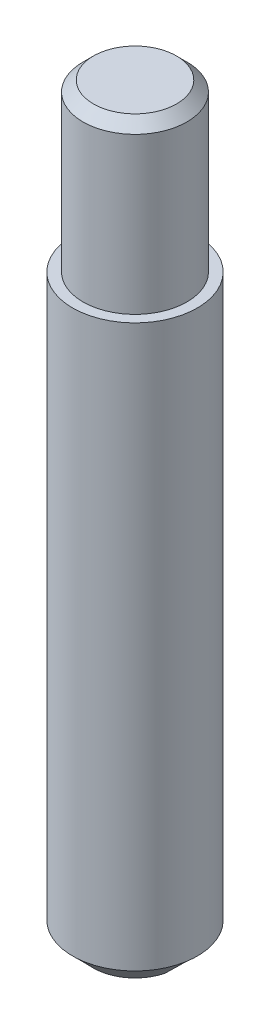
ISO-10303-21;
HEADER;
FILE_DESCRIPTION(('STEP AP214'),'2;1');
FILE_NAME('part.step','',(''),(''),'','','');
FILE_SCHEMA(('AUTOMOTIVE_DESIGN { 1 0 10303 214 1 1 1 1 }'));
ENDSEC;
DATA;
#1=APPLICATION_CONTEXT('core data for automotive mechanical design processes');
#2=APPLICATION_PROTOCOL_DEFINITION('international standard','automotive_design',2000,#1);
#3=PRODUCT_CONTEXT('',#1,'mechanical');
#4=PRODUCT('Part','Part','',(#3));
#5=PRODUCT_RELATED_PRODUCT_CATEGORY('part','',(#4));
#6=PRODUCT_DEFINITION_FORMATION('','',#4);
#7=PRODUCT_DEFINITION_CONTEXT('part definition',#1,'design');
#8=PRODUCT_DEFINITION('design','',#6,#7);
#9=PRODUCT_DEFINITION_SHAPE('','',#8);
#10=(LENGTH_UNIT() NAMED_UNIT(*) SI_UNIT(.MILLI.,.METRE.));
#11=(NAMED_UNIT(*) PLANE_ANGLE_UNIT() SI_UNIT($,.RADIAN.));
#12=(NAMED_UNIT(*) SI_UNIT($,.STERADIAN.) SOLID_ANGLE_UNIT());
#13=UNCERTAINTY_MEASURE_WITH_UNIT(LENGTH_MEASURE(1.E-05),#10,'distance_accuracy_value','');
#14=(GEOMETRIC_REPRESENTATION_CONTEXT(3) GLOBAL_UNCERTAINTY_ASSIGNED_CONTEXT((#13)) GLOBAL_UNIT_ASSIGNED_CONTEXT((#10,
#11,#12)) REPRESENTATION_CONTEXT('',''));
#15=CARTESIAN_POINT('',(0.,0.,0.));
#16=DIRECTION('',(0.,0.,1.));
#17=DIRECTION('',(1.,0.,0.));
#18=AXIS2_PLACEMENT_3D('',#15,#16,#17);
#19=CARTESIAN_POINT('',(0.,0.,0.));
#20=DIRECTION('',(0.,1.,0.));
#21=DIRECTION('',(0.,0.,1.));
#22=AXIS2_PLACEMENT_3D('',#19,#20,#21);
#23=PLANE('',#22);
#24=CARTESIAN_POINT('',(0.,0.,0.));
#25=DIRECTION('',(0.,1.,0.));
#26=DIRECTION('',(0.,0.,1.));
#27=AXIS2_PLACEMENT_3D('',#24,#25,#26);
#28=CIRCLE('',#27,2.);
#29=CARTESIAN_POINT('',(-1.93649167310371,0.,-0.5));
#30=VERTEX_POINT('',#29);
#31=CARTESIAN_POINT('',(1.93649167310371,0.,-0.5));
#32=VERTEX_POINT('',#31);
#33=EDGE_CURVE('E89',#30,#32,#28,.F.);
#34=ORIENTED_EDGE('',*,*,#33,.T.);
#35=DIRECTION('',(1.,0.,0.));
#36=VECTOR('',#35,1.);
#37=CARTESIAN_POINT('',(-4.0373892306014,0.,-0.5));
#38=LINE('',#37,#36);
#39=EDGE_CURVE('E87',#30,#32,#38,.T.);
#40=ORIENTED_EDGE('',*,*,#39,.F.);
#41=EDGE_LOOP('',(#34,#40));
#42=FACE_BOUND('',#41,.T.);
#43=ADVANCED_FACE('F30',(#42),#23,.F.);
#44=CARTESIAN_POINT('',(0.,0.999999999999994,0.));
#45=DIRECTION('',(0.,1.,0.));
#46=DIRECTION('',(0.,0.,1.));
#47=AXIS2_PLACEMENT_3D('',#44,#45,#46);
#48=CONICAL_SURFACE('',#47,3.,0.78539816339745);
#49=CARTESIAN_POINT('',(-6.63103347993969,4.64985751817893,-0.5));
#50=CARTESIAN_POINT('',(-6.39629582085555,4.41579013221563,-0.5));
#51=CARTESIAN_POINT('',(-6.1615284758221,4.18175248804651,-0.5));
#52=CARTESIAN_POINT('',(-5.69188584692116,3.71376898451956,-0.5));
#53=CARTESIAN_POINT('',(-5.45701055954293,3.47982312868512,-0.5));
#54=CARTESIAN_POINT('',(-4.98691869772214,3.0118716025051,-0.5));
#55=CARTESIAN_POINT('',(-4.75170200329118,2.77786605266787,-0.5));
#56=CARTESIAN_POINT('',(-4.28105975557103,2.31008118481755,-0.5));
#57=CARTESIAN_POINT('',(-4.04563420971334,2.07630185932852,-0.5));
#58=CARTESIAN_POINT('',(-3.58442332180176,1.61900696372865,-0.5));
#59=CARTESIAN_POINT('',(-3.35865262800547,1.39547663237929,-0.5));
#60=CARTESIAN_POINT('',(-3.01954668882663,1.06061302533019,-0.5));
#61=CARTESIAN_POINT('',(-2.90643048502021,0.949058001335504,-0.5));
#62=CARTESIAN_POINT('',(-2.67999103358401,0.726160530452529,-0.5));
#63=CARTESIAN_POINT('',(-2.56666778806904,0.614818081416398,-0.5));
#64=CARTESIAN_POINT('',(-2.33977921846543,0.392498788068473,-0.5));
#65=CARTESIAN_POINT('',(-2.22621405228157,0.281521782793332,-0.5));
#66=CARTESIAN_POINT('',(-1.99861397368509,0.0600415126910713,-0.5));
#67=CARTESIAN_POINT('',(-1.88457904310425,-0.0504617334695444,-0.5));
#68=CARTESIAN_POINT('',(-1.65577376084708,-0.270666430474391,-0.5));
#69=CARTESIAN_POINT('',(-1.54100354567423,-0.380368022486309,-0.5));
#70=CARTESIAN_POINT('',(-1.36779766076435,-0.543800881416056,-0.5));
#71=CARTESIAN_POINT('',(-1.30988912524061,-0.598090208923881,-0.5));
#72=CARTESIAN_POINT('',(-1.19356388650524,-0.706121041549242,-0.5));
#73=CARTESIAN_POINT('',(-1.13514719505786,-0.759862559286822,-0.5));
#74=CARTESIAN_POINT('',(-1.04371167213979,-0.842784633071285,-0.5));
#75=CARTESIAN_POINT('',(-1.01095596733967,-0.872255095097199,-0.5));
#76=CARTESIAN_POINT('',(-0.945138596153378,-0.930859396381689,-0.5));
#77=CARTESIAN_POINT('',(-0.912076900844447,-0.95999320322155,-0.5));
#78=CARTESIAN_POINT('',(-0.845330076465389,-1.01800796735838,-0.5));
#79=CARTESIAN_POINT('',(-0.811642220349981,-1.04688579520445,-0.5));
#80=CARTESIAN_POINT('',(-0.743741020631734,-1.10400170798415,-0.5));
#81=CARTESIAN_POINT('',(-0.709527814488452,-1.13223995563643,-0.5));
#82=CARTESIAN_POINT('',(-0.640097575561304,-1.18803130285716,-0.5));
#83=CARTESIAN_POINT('',(-0.604874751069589,-1.2155772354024,-0.5));
#84=CARTESIAN_POINT('',(-0.533390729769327,-1.26928306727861,-0.5));
#85=CARTESIAN_POINT('',(-0.497129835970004,-1.29544336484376,-0.5));
#86=CARTESIAN_POINT('',(-0.423306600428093,-1.34543807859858,-0.5));
#87=CARTESIAN_POINT('',(-0.385752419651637,-1.36928438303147,-0.5));
#88=CARTESIAN_POINT('',(-0.308583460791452,-1.41329936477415,-0.5));
#89=CARTESIAN_POINT('',(-0.268974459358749,-1.43347770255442,-0.5));
#90=CARTESIAN_POINT('',(-0.197288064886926,-1.46320514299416,-0.5));
#91=CARTESIAN_POINT('',(-0.165811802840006,-1.4741507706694,-0.5));
#92=CARTESIAN_POINT('',(-0.101560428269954,-1.4907222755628,-0.5));
#93=CARTESIAN_POINT('',(-0.0687922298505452,-1.49637328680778,-0.5));
#94=CARTESIAN_POINT('',(-0.00241834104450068,-1.50109442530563,-0.5));
#95=CARTESIAN_POINT('',(0.0311924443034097,-1.50009829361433,-0.5));
#96=CARTESIAN_POINT('',(0.0976414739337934,-1.49163681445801,-0.5));
#97=CARTESIAN_POINT('',(0.130476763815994,-1.4841498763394,-0.5));
#98=CARTESIAN_POINT('',(0.186425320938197,-1.46686488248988,-0.5));
#99=CARTESIAN_POINT('',(0.209891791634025,-1.4581349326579,-0.5));
#100=CARTESIAN_POINT('',(0.255987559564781,-1.43866809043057,-0.5));
#101=CARTESIAN_POINT('',(0.278616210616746,-1.42792968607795,-0.5));
#102=CARTESIAN_POINT('',(0.323210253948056,-1.40493918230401,-0.5));
#103=CARTESIAN_POINT('',(0.345172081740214,-1.39268029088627,-0.5));
#104=CARTESIAN_POINT('',(0.388439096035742,-1.36708370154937,-0.5));
#105=CARTESIAN_POINT('',(0.409744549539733,-1.3537464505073,-0.5));
#106=CARTESIAN_POINT('',(0.480878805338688,-1.30733418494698,-0.5));
#107=CARTESIAN_POINT('',(0.529498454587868,-1.27241897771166,-0.5));
#108=CARTESIAN_POINT('',(0.62496859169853,-1.20023227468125,-0.5));
#109=CARTESIAN_POINT('',(0.671817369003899,-1.16295858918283,-0.5));
#110=CARTESIAN_POINT('',(0.764476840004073,-1.08691539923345,-0.5));
#111=CARTESIAN_POINT('',(0.810284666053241,-1.0481424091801,-0.5));
#112=CARTESIAN_POINT('',(0.901106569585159,-0.969722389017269,-0.5));
#113=CARTESIAN_POINT('',(0.946120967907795,-0.930075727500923,-0.5));
#114=CARTESIAN_POINT('',(1.03570334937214,-0.850098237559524,-0.5));
#115=CARTESIAN_POINT('',(1.08027022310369,-0.809766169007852,-0.5));
#116=CARTESIAN_POINT('',(1.16901708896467,-0.728670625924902,-0.5));
#117=CARTESIAN_POINT('',(1.21319704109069,-0.687907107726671,-0.5));
#118=CARTESIAN_POINT('',(1.34516756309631,-0.565284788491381,-0.5));
#119=CARTESIAN_POINT('',(1.43253048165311,-0.48296621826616,-0.5));
#120=CARTESIAN_POINT('',(1.60576074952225,-0.318406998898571,-0.5));
#121=CARTESIAN_POINT('',(1.69163442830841,-0.236172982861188,-0.5));
#122=CARTESIAN_POINT('',(1.86295068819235,-0.071256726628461,-0.5));
#123=CARTESIAN_POINT('',(1.94839326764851,0.0114255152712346,-0.5));
#124=CARTESIAN_POINT('',(2.20429665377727,0.259920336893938,-0.5));
#125=CARTESIAN_POINT('',(2.37432728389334,0.426175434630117,-0.5));
#126=CARTESIAN_POINT('',(2.71390428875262,0.759391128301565,-0.5));
#127=CARTESIAN_POINT('',(2.88345029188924,0.926352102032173,-0.5));
#128=CARTESIAN_POINT('',(3.22218395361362,1.2606317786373,-0.5));
#129=CARTESIAN_POINT('',(3.39137161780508,1.42795047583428,-0.5));
#130=CARTESIAN_POINT('',(3.7291005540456,1.76239888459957,-0.5));
#131=CARTESIAN_POINT('',(3.89764238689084,1.92952803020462,-0.5));
#132=CARTESIAN_POINT('',(4.23457368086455,2.26394120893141,-0.5));
#133=CARTESIAN_POINT('',(4.40296314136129,2.43122524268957,-0.5));
#134=CARTESIAN_POINT('',(4.90791715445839,2.93318294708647,-0.5));
#135=CARTESIAN_POINT('',(5.2443224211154,3.26801683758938,-0.5));
#136=CARTESIAN_POINT('',(5.66813547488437,3.69014087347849,-0.5));
#137=CARTESIAN_POINT('',(5.75565083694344,3.77732308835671,-0.5));
#138=CARTESIAN_POINT('',(5.93066959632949,3.95170437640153,-0.5));
#139=CARTESIAN_POINT('',(6.01817299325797,4.03890344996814,-0.5));
#140=CARTESIAN_POINT('',(6.19324345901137,4.21338987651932,-0.5));
#141=CARTESIAN_POINT('',(6.28081051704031,4.30067724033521,-0.5));
#142=CARTESIAN_POINT('',(6.45593115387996,4.47526062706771,-0.5));
#143=CARTESIAN_POINT('',(6.5434847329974,4.56255664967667,-0.5));
#144=CARTESIAN_POINT('',(6.63103347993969,4.64985751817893,-0.5));
#145=B_SPLINE_CURVE_WITH_KNOTS('',3,(#49,#50,#51,#52,#53,#54,#55,#56,#57,#58,#59,#60,#61,#62,
#63,#64,#65,#66,#67,#68,#69,#70,#71,#72,#73,#74,#75,#76,#77,#78,#79,#80,#81,#82,#83,#84,#85,#86,
#87,#88,#89,#90,#91,#92,#93,#94,#95,#96,#97,#98,#99,#100,#101,#102,#103,#104,#105,#106,#107,
#108,#109,#110,#111,#112,#113,#114,#115,#116,#117,#118,#119,#120,#121,#122,#123,#124,#125,#126,
#127,#128,#129,#130,#131,#132,#133,#134,#135,#136,#137,#138,#139,#140,#141,#142,#143,#144),
.UNSPECIFIED.,.F.,.F.,(4,2,2,2,2,2,2,2,2,2,2,2,2,2,2,2,2,2,2,2,2,2,2,2,2,2,2,2,2,2,2,2,2,2,2,2,
2,2,2,2,2,2,2,2,2,2,2,4),(0.,0.994486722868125,1.98900847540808,2.9843823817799,
3.97972218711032,4.93284471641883,5.40945566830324,5.88606177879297,6.36241822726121,
6.83879327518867,7.31508230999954,7.55321172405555,7.79133563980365,7.92351941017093,
8.05571580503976,8.18882389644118,8.32189773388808,8.45602191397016,8.59010733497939,
8.72346269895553,8.85646158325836,8.95611915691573,9.0553012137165,9.15547338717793,
9.25598005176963,9.33099001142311,9.40605666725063,9.48147161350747,9.55685546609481,
9.73626223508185,9.91583808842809,10.095860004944,10.2758073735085,10.4561250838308,
10.6364612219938,10.9965607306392,11.3532528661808,11.7099463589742,12.4233575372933,
13.1372171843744,13.8510655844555,14.5631374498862,15.2752122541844,16.6991291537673,
17.0697193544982,17.4403198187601,17.811242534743,18.1821549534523),.UNSPECIFIED.);
#146=CARTESIAN_POINT('',(-2.95803989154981,1.,-0.5));
#147=VERTEX_POINT('',#146);
#148=EDGE_CURVE('E11',#147,#30,#145,.T.);
#149=ORIENTED_EDGE('',*,*,#148,.F.);
#150=CARTESIAN_POINT('',(0.,0.999999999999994,0.));
#151=DIRECTION('',(0.,1.,0.));
#152=DIRECTION('',(0.,0.,1.));
#153=AXIS2_PLACEMENT_3D('',#150,#151,#152);
#154=CIRCLE('',#153,3.);
#155=CARTESIAN_POINT('',(2.95803989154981,0.999999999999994,-0.499999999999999));
#156=VERTEX_POINT('',#155);
#157=EDGE_CURVE('E94',#156,#147,#154,.T.);
#158=ORIENTED_EDGE('',*,*,#157,.F.);
#159=EDGE_CURVE('E35',#32,#156,#145,.T.);
#160=ORIENTED_EDGE('',*,*,#159,.F.);
#161=ORIENTED_EDGE('',*,*,#33,.F.);
#162=EDGE_LOOP('',(#149,#158,#160,#161));
#163=FACE_BOUND('',#162,.T.);
#164=ADVANCED_FACE('F122',(#163),#48,.T.);
#165=CARTESIAN_POINT('',(0.,28.,0.));
#166=DIRECTION('',(0.,1.,0.));
#167=DIRECTION('',(0.,0.,1.));
#168=AXIS2_PLACEMENT_3D('',#165,#166,#167);
#169=PLANE('',#168);
#170=CARTESIAN_POINT('',(0.,28.,0.));
#171=DIRECTION('',(0.,1.,0.));
#172=DIRECTION('',(0.,0.,1.));
#173=AXIS2_PLACEMENT_3D('',#170,#171,#172);
#174=CIRCLE('',#173,3.);
#175=CARTESIAN_POINT('',(0.,28.,3.));
#176=VERTEX_POINT('',#175);
#177=EDGE_CURVE('E155',#176,#176,#174,.T.);
#178=ORIENTED_EDGE('',*,*,#177,.T.);
#179=EDGE_LOOP('',(#178));
#180=FACE_BOUND('',#179,.T.);
#181=CARTESIAN_POINT('',(0.,28.,0.));
#182=DIRECTION('',(0.,1.,0.));
#183=DIRECTION('',(0.,0.,1.));
#184=AXIS2_PLACEMENT_3D('',#181,#182,#183);
#185=CIRCLE('',#184,2.5);
#186=CARTESIAN_POINT('',(0.,28.,2.5));
#187=VERTEX_POINT('',#186);
#188=EDGE_CURVE('E152',#187,#187,#185,.T.);
#189=ORIENTED_EDGE('',*,*,#188,.F.);
#190=EDGE_LOOP('',(#189));
#191=FACE_BOUND('',#190,.T.);
#192=ADVANCED_FACE('F118',(#180,#191),#169,.T.);
#193=CARTESIAN_POINT('',(0.,28.,0.));
#194=DIRECTION('',(0.,-1.,0.));
#195=DIRECTION('',(0.,0.,-1.));
#196=AXIS2_PLACEMENT_3D('',#193,#194,#195);
#197=CYLINDRICAL_SURFACE('',#196,3.);
#198=CARTESIAN_POINT('',(2.95803989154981,1.,0.5));
#199=VERTEX_POINT('',#198);
#200=EDGE_CURVE('E90',#199,#156,#154,.T.);
#201=ORIENTED_EDGE('',*,*,#200,.T.);
#202=ORIENTED_EDGE('',*,*,#157,.T.);
#203=CARTESIAN_POINT('',(-2.95803989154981,1.,0.5));
#204=VERTEX_POINT('',#203);
#205=EDGE_CURVE('E162',#147,#204,#154,.T.);
#206=ORIENTED_EDGE('',*,*,#205,.T.);
#207=EDGE_CURVE('E96',#204,#199,#154,.T.);
#208=ORIENTED_EDGE('',*,*,#207,.T.);
#209=EDGE_LOOP('',(#201,#202,#206,#208));
#210=FACE_BOUND('',#209,.T.);
#211=ORIENTED_EDGE('',*,*,#177,.F.);
#212=EDGE_LOOP('',(#211));
#213=FACE_BOUND('',#212,.T.);
#214=ADVANCED_FACE('F121',(#210,#213),#197,.T.);
#215=CARTESIAN_POINT('',(1.93649167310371,0.,0.5));
#216=VERTEX_POINT('',#215);
#217=CARTESIAN_POINT('',(-1.93649167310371,0.,0.5));
#218=VERTEX_POINT('',#217);
#219=EDGE_CURVE('E86',#216,#218,#28,.F.);
#220=ORIENTED_EDGE('',*,*,#219,.T.);
#221=DIRECTION('',(-1.,0.,0.));
#222=VECTOR('',#221,1.);
#223=CARTESIAN_POINT('',(-3.94010274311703,0.,0.5));
#224=LINE('',#223,#222);
#225=EDGE_CURVE('E77',#216,#218,#224,.T.);
#226=ORIENTED_EDGE('',*,*,#225,.F.);
#227=EDGE_LOOP('',(#220,#226));
#228=FACE_BOUND('',#227,.T.);
#229=ADVANCED_FACE('F85',(#228),#23,.F.);
#230=CARTESIAN_POINT('',(0.,36.,0.));
#231=DIRECTION('',(0.,-1.,0.));
#232=DIRECTION('',(0.,0.,-1.));
#233=AXIS2_PLACEMENT_3D('',#230,#231,#232);
#234=CYLINDRICAL_SURFACE('',#233,2.5);
#235=CARTESIAN_POINT('',(0.,35.5,0.));
#236=DIRECTION('',(0.,1.,0.));
#237=DIRECTION('',(0.,0.,1.));
#238=AXIS2_PLACEMENT_3D('',#235,#236,#237);
#239=CIRCLE('',#238,2.5);
#240=CARTESIAN_POINT('',(0.,35.5,2.5));
#241=VERTEX_POINT('',#240);
#242=EDGE_CURVE('E160',#241,#241,#239,.F.);
#243=ORIENTED_EDGE('',*,*,#242,.T.);
#244=EDGE_LOOP('',(#243));
#245=FACE_BOUND('',#244,.T.);
#246=ORIENTED_EDGE('',*,*,#188,.T.);
#247=EDGE_LOOP('',(#246));
#248=FACE_BOUND('',#247,.T.);
#249=ADVANCED_FACE('F113',(#245,#248),#234,.T.);
#250=CARTESIAN_POINT('',(0.,36.,0.));
#251=DIRECTION('',(0.,1.,0.));
#252=DIRECTION('',(0.,0.,1.));
#253=AXIS2_PLACEMENT_3D('',#250,#251,#252);
#254=PLANE('',#253);
#255=CARTESIAN_POINT('',(0.,36.,0.));
#256=DIRECTION('',(0.,1.,0.));
#257=DIRECTION('',(0.,0.,1.));
#258=AXIS2_PLACEMENT_3D('',#255,#256,#257);
#259=CIRCLE('',#258,1.99999999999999);
#260=CARTESIAN_POINT('',(0.,36.,1.99999999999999));
#261=VERTEX_POINT('',#260);
#262=EDGE_CURVE('E158',#261,#261,#259,.T.);
#263=ORIENTED_EDGE('',*,*,#262,.T.);
#264=EDGE_LOOP('',(#263));
#265=FACE_BOUND('',#264,.T.);
#266=ADVANCED_FACE('F109',(#265),#254,.T.);
#267=CARTESIAN_POINT('',(0.,36.,0.));
#268=DIRECTION('',(0.,-1.,0.));
#269=DIRECTION('',(0.,0.,-1.));
#270=AXIS2_PLACEMENT_3D('',#267,#268,#269);
#271=CONICAL_SURFACE('',#270,1.99999999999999,0.78539816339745);
#272=ORIENTED_EDGE('',*,*,#242,.F.);
#273=EDGE_LOOP('',(#272));
#274=FACE_BOUND('',#273,.T.);
#275=ORIENTED_EDGE('',*,*,#262,.F.);
#276=EDGE_LOOP('',(#275));
#277=FACE_BOUND('',#276,.T.);
#278=ADVANCED_FACE('F112',(#274,#277),#271,.T.);
#279=CARTESIAN_POINT('',(6.63103347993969,4.64985751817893,0.5));
#280=CARTESIAN_POINT('',(6.39629582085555,4.41579013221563,0.5));
#281=CARTESIAN_POINT('',(6.1615284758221,4.18175248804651,0.5));
#282=CARTESIAN_POINT('',(5.69188584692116,3.71376898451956,0.5));
#283=CARTESIAN_POINT('',(5.45701055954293,3.47982312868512,0.5));
#284=CARTESIAN_POINT('',(4.98691869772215,3.0118716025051,0.5));
#285=CARTESIAN_POINT('',(4.75170200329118,2.77786605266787,0.5));
#286=CARTESIAN_POINT('',(4.28105975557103,2.31008118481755,0.5));
#287=CARTESIAN_POINT('',(4.04563420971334,2.07630185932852,0.5));
#288=CARTESIAN_POINT('',(3.58442332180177,1.61900696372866,0.5));
#289=CARTESIAN_POINT('',(3.35865262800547,1.3954766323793,0.5));
#290=CARTESIAN_POINT('',(3.01954668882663,1.06061302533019,0.5));
#291=CARTESIAN_POINT('',(2.90643048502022,0.949058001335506,0.5));
#292=CARTESIAN_POINT('',(2.67999103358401,0.72616053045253,0.5));
#293=CARTESIAN_POINT('',(2.56666778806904,0.6148180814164,0.5));
#294=CARTESIAN_POINT('',(2.33977921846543,0.392498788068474,0.5));
#295=CARTESIAN_POINT('',(2.22621405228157,0.281521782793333,0.5));
#296=CARTESIAN_POINT('',(1.99861397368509,0.0600415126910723,0.5));
#297=CARTESIAN_POINT('',(1.88457904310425,-0.0504617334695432,0.5));
#298=CARTESIAN_POINT('',(1.65577376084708,-0.27066643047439,0.5));
#299=CARTESIAN_POINT('',(1.54100354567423,-0.380368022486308,0.5));
#300=CARTESIAN_POINT('',(1.36779766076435,-0.543800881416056,0.5));
#301=CARTESIAN_POINT('',(1.30988912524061,-0.598090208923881,0.5));
#302=CARTESIAN_POINT('',(1.19356388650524,-0.706121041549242,0.5));
#303=CARTESIAN_POINT('',(1.13514719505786,-0.759862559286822,0.5));
#304=CARTESIAN_POINT('',(1.04371167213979,-0.842784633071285,0.5));
#305=CARTESIAN_POINT('',(1.01095596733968,-0.872255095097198,0.5));
#306=CARTESIAN_POINT('',(0.945138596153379,-0.930859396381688,0.5));
#307=CARTESIAN_POINT('',(0.912076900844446,-0.959993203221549,0.5));
#308=CARTESIAN_POINT('',(0.845330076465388,-1.01800796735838,0.5));
#309=CARTESIAN_POINT('',(0.811642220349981,-1.04688579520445,0.5));
#310=CARTESIAN_POINT('',(0.743741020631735,-1.10400170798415,0.5));
#311=CARTESIAN_POINT('',(0.709527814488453,-1.13223995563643,0.5));
#312=CARTESIAN_POINT('',(0.640097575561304,-1.18803130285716,0.5));
#313=CARTESIAN_POINT('',(0.604874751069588,-1.2155772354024,0.5));
#314=CARTESIAN_POINT('',(0.533390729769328,-1.26928306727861,0.5));
#315=CARTESIAN_POINT('',(0.497129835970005,-1.29544336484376,0.5));
#316=CARTESIAN_POINT('',(0.423306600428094,-1.34543807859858,0.5));
#317=CARTESIAN_POINT('',(0.385752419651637,-1.36928438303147,0.5));
#318=CARTESIAN_POINT('',(0.308583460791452,-1.41329936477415,0.5));
#319=CARTESIAN_POINT('',(0.268974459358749,-1.43347770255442,0.5));
#320=CARTESIAN_POINT('',(0.197288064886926,-1.46320514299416,0.5));
#321=CARTESIAN_POINT('',(0.165811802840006,-1.4741507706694,0.5));
#322=CARTESIAN_POINT('',(0.101560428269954,-1.4907222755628,0.5));
#323=CARTESIAN_POINT('',(0.0687922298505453,-1.49637328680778,0.5));
#324=CARTESIAN_POINT('',(0.0024183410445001,-1.50109442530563,0.5));
#325=CARTESIAN_POINT('',(-0.0311924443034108,-1.50009829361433,0.5));
#326=CARTESIAN_POINT('',(-0.0976414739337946,-1.49163681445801,0.5));
#327=CARTESIAN_POINT('',(-0.130476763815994,-1.4841498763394,0.5));
#328=CARTESIAN_POINT('',(-0.186425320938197,-1.46686488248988,0.5));
#329=CARTESIAN_POINT('',(-0.209891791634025,-1.4581349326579,0.5));
#330=CARTESIAN_POINT('',(-0.255987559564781,-1.43866809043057,0.5));
#331=CARTESIAN_POINT('',(-0.278616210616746,-1.42792968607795,0.5));
#332=CARTESIAN_POINT('',(-0.323210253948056,-1.40493918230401,0.5));
#333=CARTESIAN_POINT('',(-0.345172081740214,-1.39268029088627,0.5));
#334=CARTESIAN_POINT('',(-0.388439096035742,-1.36708370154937,0.5));
#335=CARTESIAN_POINT('',(-0.409744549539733,-1.3537464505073,0.5));
#336=CARTESIAN_POINT('',(-0.480878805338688,-1.30733418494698,0.5));
#337=CARTESIAN_POINT('',(-0.529498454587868,-1.27241897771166,0.5));
#338=CARTESIAN_POINT('',(-0.624968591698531,-1.20023227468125,0.5));
#339=CARTESIAN_POINT('',(-0.671817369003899,-1.16295858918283,0.5));
#340=CARTESIAN_POINT('',(-0.764476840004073,-1.08691539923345,0.5));
#341=CARTESIAN_POINT('',(-0.810284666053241,-1.0481424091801,0.5));
#342=CARTESIAN_POINT('',(-0.901106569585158,-0.969722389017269,0.5));
#343=CARTESIAN_POINT('',(-0.946120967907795,-0.930075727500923,0.5));
#344=CARTESIAN_POINT('',(-1.03570334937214,-0.850098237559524,0.5));
#345=CARTESIAN_POINT('',(-1.08027022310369,-0.809766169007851,0.5));
#346=CARTESIAN_POINT('',(-1.16901708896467,-0.7286706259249,0.5));
#347=CARTESIAN_POINT('',(-1.21319704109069,-0.68790710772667,0.5));
#348=CARTESIAN_POINT('',(-1.34516756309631,-0.56528478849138,0.5));
#349=CARTESIAN_POINT('',(-1.43253048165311,-0.48296621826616,0.5));
#350=CARTESIAN_POINT('',(-1.60576074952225,-0.318406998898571,0.5));
#351=CARTESIAN_POINT('',(-1.69163442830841,-0.236172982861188,0.5));
#352=CARTESIAN_POINT('',(-1.86295068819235,-0.071256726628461,0.5));
#353=CARTESIAN_POINT('',(-1.94839326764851,0.0114255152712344,0.5));
#354=CARTESIAN_POINT('',(-2.20429665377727,0.259920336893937,0.5));
#355=CARTESIAN_POINT('',(-2.37432728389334,0.426175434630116,0.5));
#356=CARTESIAN_POINT('',(-2.71390428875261,0.759391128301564,0.5));
#357=CARTESIAN_POINT('',(-2.88345029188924,0.926352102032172,0.5));
#358=CARTESIAN_POINT('',(-3.22218395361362,1.2606317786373,0.5));
#359=CARTESIAN_POINT('',(-3.39137161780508,1.42795047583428,0.5));
#360=CARTESIAN_POINT('',(-3.7291005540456,1.76239888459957,0.5));
#361=CARTESIAN_POINT('',(-3.89764238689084,1.92952803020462,0.5));
#362=CARTESIAN_POINT('',(-4.23457368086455,2.26394120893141,0.5));
#363=CARTESIAN_POINT('',(-4.40296314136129,2.43122524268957,0.5));
#364=CARTESIAN_POINT('',(-4.90791715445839,2.93318294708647,0.5));
#365=CARTESIAN_POINT('',(-5.24432242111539,3.26801683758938,0.5));
#366=CARTESIAN_POINT('',(-5.66813547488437,3.69014087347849,0.5));
#367=CARTESIAN_POINT('',(-5.75565083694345,3.77732308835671,0.5));
#368=CARTESIAN_POINT('',(-5.93066959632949,3.95170437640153,0.5));
#369=CARTESIAN_POINT('',(-6.01817299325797,4.03890344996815,0.5));
#370=CARTESIAN_POINT('',(-6.19324345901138,4.21338987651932,0.5));
#371=CARTESIAN_POINT('',(-6.28081051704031,4.30067724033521,0.5));
#372=CARTESIAN_POINT('',(-6.45593115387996,4.47526062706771,0.5));
#373=CARTESIAN_POINT('',(-6.5434847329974,4.56255664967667,0.5));
#374=CARTESIAN_POINT('',(-6.63103347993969,4.64985751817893,0.5));
#375=B_SPLINE_CURVE_WITH_KNOTS('',3,(#279,#280,#281,#282,#283,#284,#285,#286,#287,#288,#289,
#290,#291,#292,#293,#294,#295,#296,#297,#298,#299,#300,#301,#302,#303,#304,#305,#306,#307,#308,
#309,#310,#311,#312,#313,#314,#315,#316,#317,#318,#319,#320,#321,#322,#323,#324,#325,#326,#327,
#328,#329,#330,#331,#332,#333,#334,#335,#336,#337,#338,#339,#340,#341,#342,#343,#344,#345,#346,
#347,#348,#349,#350,#351,#352,#353,#354,#355,#356,#357,#358,#359,#360,#361,#362,#363,#364,#365,
#366,#367,#368,#369,#370,#371,#372,#373,#374),.UNSPECIFIED.,.F.,.F.,(4,2,2,2,2,2,2,2,2,2,2,2,2,
2,2,2,2,2,2,2,2,2,2,2,2,2,2,2,2,2,2,2,2,2,2,2,2,2,2,2,2,2,2,2,2,2,2,4),(0.,0.994486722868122,
1.98900847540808,2.9843823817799,3.97972218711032,4.93284471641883,5.40945566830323,
5.88606177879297,6.3624182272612,6.83879327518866,7.31508230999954,7.55321172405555,
7.79133563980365,7.92351941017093,8.05571580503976,8.18882389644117,8.32189773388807,
8.45602191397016,8.59010733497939,8.72346269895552,8.85646158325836,8.95611915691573,
9.05530121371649,9.15547338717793,9.25598005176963,9.33099001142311,9.40605666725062,
9.48147161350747,9.55685546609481,9.73626223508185,9.91583808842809,10.095860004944,
10.2758073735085,10.4561250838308,10.6364612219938,10.9965607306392,11.3532528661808,
11.7099463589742,12.4233575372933,13.1372171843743,13.8510655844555,14.5631374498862,
15.2752122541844,16.6991291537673,17.0697193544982,17.4403198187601,17.811242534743,
18.1821549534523),.UNSPECIFIED.);
#376=EDGE_CURVE('E74',#199,#216,#375,.T.);
#377=ORIENTED_EDGE('',*,*,#376,.F.);
#378=ORIENTED_EDGE('',*,*,#207,.F.);
#379=EDGE_CURVE('E58',#218,#204,#375,.T.);
#380=ORIENTED_EDGE('',*,*,#379,.F.);
#381=ORIENTED_EDGE('',*,*,#219,.F.);
#382=EDGE_LOOP('',(#377,#378,#380,#381));
#383=FACE_BOUND('',#382,.T.);
#384=ADVANCED_FACE('F32',(#383),#48,.T.);
#385=CARTESIAN_POINT('',(-4.0373892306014,1.,-0.5));
#386=DIRECTION('',(0.,0.,-1.));
#387=DIRECTION('',(-1.,0.,0.));
#388=AXIS2_PLACEMENT_3D('',#385,#386,#387);
#389=PLANE('',#388);
#390=ORIENTED_EDGE('',*,*,#148,.T.);
#391=ORIENTED_EDGE('',*,*,#39,.T.);
#392=ORIENTED_EDGE('',*,*,#159,.T.);
#393=DIRECTION('',(1.,0.,0.));
#394=VECTOR('',#393,1.);
#395=CARTESIAN_POINT('',(-4.0373892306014,1.,-0.5));
#396=LINE('',#395,#394);
#397=EDGE_CURVE('E50',#147,#156,#396,.T.);
#398=ORIENTED_EDGE('',*,*,#397,.F.);
#399=EDGE_LOOP('',(#390,#391,#392,#398));
#400=FACE_BOUND('',#399,.T.);
#401=ADVANCED_FACE('F106',(#400),#389,.F.);
#402=CARTESIAN_POINT('',(-3.94010274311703,1.,0.5));
#403=DIRECTION('',(0.,0.,1.));
#404=DIRECTION('',(1.,0.,0.));
#405=AXIS2_PLACEMENT_3D('',#402,#403,#404);
#406=PLANE('',#405);
#407=ORIENTED_EDGE('',*,*,#376,.T.);
#408=ORIENTED_EDGE('',*,*,#225,.T.);
#409=ORIENTED_EDGE('',*,*,#379,.T.);
#410=DIRECTION('',(-1.,0.,0.));
#411=VECTOR('',#410,1.);
#412=CARTESIAN_POINT('',(-3.94010274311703,1.,0.5));
#413=LINE('',#412,#411);
#414=EDGE_CURVE('E78',#199,#204,#413,.T.);
#415=ORIENTED_EDGE('',*,*,#414,.F.);
#416=EDGE_LOOP('',(#407,#408,#409,#415));
#417=FACE_BOUND('',#416,.T.);
#418=ADVANCED_FACE('F76',(#417),#406,.F.);
#419=CARTESIAN_POINT('',(4.05360364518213,1.,-0.5));
#420=DIRECTION('',(0.,-1.,0.));
#421=DIRECTION('',(0.,0.,-1.));
#422=AXIS2_PLACEMENT_3D('',#419,#420,#421);
#423=PLANE('',#422);
#424=ORIENTED_EDGE('',*,*,#397,.T.);
#425=ORIENTED_EDGE('',*,*,#200,.F.);
#426=ORIENTED_EDGE('',*,*,#414,.T.);
#427=ORIENTED_EDGE('',*,*,#205,.F.);
#428=EDGE_LOOP('',(#424,#425,#426,#427));
#429=FACE_BOUND('',#428,.T.);
#430=ADVANCED_FACE('F105',(#429),#423,.T.);
#431=CLOSED_SHELL('',(#43,#164,#192,#214,#229,#249,#266,#278,#384,#401,#418,#430));
#432=MANIFOLD_SOLID_BREP('B2',#431);
#433=ADVANCED_BREP_SHAPE_REPRESENTATION('',(#18,#432),#14);
#434=SHAPE_DEFINITION_REPRESENTATION(#9,#433);
ENDSEC;
END-ISO-10303-21;
